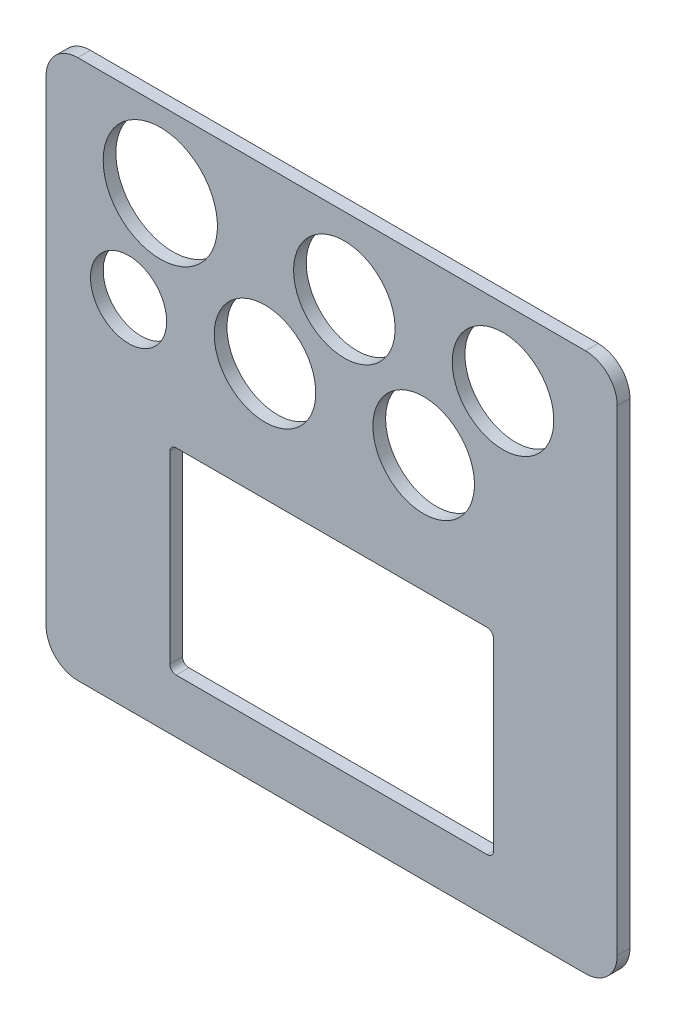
ISO-10303-21;
HEADER;
FILE_DESCRIPTION(('STEP AP214'),'2;1');
FILE_NAME('part.step','',(''),(''),'','','');
FILE_SCHEMA(('AUTOMOTIVE_DESIGN { 1 0 10303 214 1 1 1 1 }'));
ENDSEC;
DATA;
#1=APPLICATION_CONTEXT('core data for automotive mechanical design processes');
#2=APPLICATION_PROTOCOL_DEFINITION('international standard','automotive_design',2000,#1);
#3=PRODUCT_CONTEXT('',#1,'mechanical');
#4=PRODUCT('Part','Part','',(#3));
#5=PRODUCT_RELATED_PRODUCT_CATEGORY('part','',(#4));
#6=PRODUCT_DEFINITION_FORMATION('','',#4);
#7=PRODUCT_DEFINITION_CONTEXT('part definition',#1,'design');
#8=PRODUCT_DEFINITION('design','',#6,#7);
#9=PRODUCT_DEFINITION_SHAPE('','',#8);
#10=(LENGTH_UNIT() NAMED_UNIT(*) SI_UNIT(.MILLI.,.METRE.));
#11=(NAMED_UNIT(*) PLANE_ANGLE_UNIT() SI_UNIT($,.RADIAN.));
#12=(NAMED_UNIT(*) SI_UNIT($,.STERADIAN.) SOLID_ANGLE_UNIT());
#13=UNCERTAINTY_MEASURE_WITH_UNIT(LENGTH_MEASURE(1.E-05),#10,'distance_accuracy_value','');
#14=(GEOMETRIC_REPRESENTATION_CONTEXT(3) GLOBAL_UNCERTAINTY_ASSIGNED_CONTEXT((#13)) GLOBAL_UNIT_ASSIGNED_CONTEXT((#10,
#11,#12)) REPRESENTATION_CONTEXT('',''));
#15=CARTESIAN_POINT('',(0.,0.,0.));
#16=DIRECTION('',(0.,0.,1.));
#17=DIRECTION('',(1.,0.,0.));
#18=AXIS2_PLACEMENT_3D('',#15,#16,#17);
#19=CARTESIAN_POINT('',(40.,-37.5,0.));
#20=DIRECTION('',(0.,0.,1.));
#21=DIRECTION('',(1.,0.,0.));
#22=AXIS2_PLACEMENT_3D('',#19,#20,#21);
#23=PLANE('',#22);
#24=CARTESIAN_POINT('',(-32.,13.5,0.));
#25=DIRECTION('',(0.,0.,1.));
#26=DIRECTION('',(1.,0.,0.));
#27=AXIS2_PLACEMENT_3D('',#24,#25,#26);
#28=CIRCLE('',#27,6.);
#29=CARTESIAN_POINT('',(-26.,13.5,0.));
#30=VERTEX_POINT('',#29);
#31=EDGE_CURVE('E502',#30,#30,#28,.F.);
#32=ORIENTED_EDGE('',*,*,#31,.F.);
#33=EDGE_LOOP('',(#32));
#34=FACE_BOUND('',#33,.T.);
#35=CARTESIAN_POINT('',(2.,30.5,0.));
#36=DIRECTION('',(0.,0.,-1.));
#37=DIRECTION('',(-1.,0.,0.));
#38=AXIS2_PLACEMENT_3D('',#35,#36,#37);
#39=CIRCLE('',#38,8.);
#40=CARTESIAN_POINT('',(-6.,30.5,0.));
#41=VERTEX_POINT('',#40);
#42=EDGE_CURVE('E487',#41,#41,#39,.T.);
#43=ORIENTED_EDGE('',*,*,#42,.F.);
#44=EDGE_LOOP('',(#43));
#45=FACE_BOUND('',#44,.T.);
#46=CARTESIAN_POINT('',(14.5,15.5,0.));
#47=DIRECTION('',(0.,0.,-1.));
#48=DIRECTION('',(-1.,0.,0.));
#49=AXIS2_PLACEMENT_3D('',#46,#47,#48);
#50=CIRCLE('',#49,8.);
#51=CARTESIAN_POINT('',(6.5,15.5,0.));
#52=VERTEX_POINT('',#51);
#53=EDGE_CURVE('E481',#52,#52,#50,.T.);
#54=ORIENTED_EDGE('',*,*,#53,.F.);
#55=EDGE_LOOP('',(#54));
#56=FACE_BOUND('',#55,.T.);
#57=CARTESIAN_POINT('',(-27.,30.5,0.));
#58=DIRECTION('',(0.,0.,-1.));
#59=DIRECTION('',(-1.,0.,0.));
#60=AXIS2_PLACEMENT_3D('',#57,#58,#59);
#61=CIRCLE('',#60,9.);
#62=CARTESIAN_POINT('',(-36.,30.5,0.));
#63=VERTEX_POINT('',#62);
#64=EDGE_CURVE('E499',#63,#63,#61,.T.);
#65=ORIENTED_EDGE('',*,*,#64,.F.);
#66=EDGE_LOOP('',(#65));
#67=FACE_BOUND('',#66,.T.);
#68=CARTESIAN_POINT('',(-10.5,15.5,0.));
#69=DIRECTION('',(0.,0.,-1.));
#70=DIRECTION('',(-1.,0.,0.));
#71=AXIS2_PLACEMENT_3D('',#68,#69,#70);
#72=CIRCLE('',#71,8.);
#73=CARTESIAN_POINT('',(-18.5,15.5,0.));
#74=VERTEX_POINT('',#73);
#75=EDGE_CURVE('E493',#74,#74,#72,.T.);
#76=ORIENTED_EDGE('',*,*,#75,.F.);
#77=EDGE_LOOP('',(#76));
#78=FACE_BOUND('',#77,.T.);
#79=CARTESIAN_POINT('',(27.,30.5,0.));
#80=DIRECTION('',(0.,0.,-1.));
#81=DIRECTION('',(-1.,0.,0.));
#82=AXIS2_PLACEMENT_3D('',#79,#80,#81);
#83=CIRCLE('',#82,8.);
#84=CARTESIAN_POINT('',(19.,30.5,0.));
#85=VERTEX_POINT('',#84);
#86=EDGE_CURVE('E475',#85,#85,#83,.T.);
#87=ORIENTED_EDGE('',*,*,#86,.F.);
#88=EDGE_LOOP('',(#87));
#89=FACE_BOUND('',#88,.T.);
#90=DIRECTION('',(1.,0.,0.));
#91=VECTOR('',#90,1.);
#92=CARTESIAN_POINT('',(25.5,-3.,0.));
#93=LINE('',#92,#91);
#94=CARTESIAN_POINT('',(-24.5,-3.,0.));
#95=VERTEX_POINT('',#94);
#96=CARTESIAN_POINT('',(24.5,-3.,0.));
#97=VERTEX_POINT('',#96);
#98=EDGE_CURVE('E352',#95,#97,#93,.T.);
#99=ORIENTED_EDGE('',*,*,#98,.F.);
#100=CARTESIAN_POINT('',(-24.5,-4.,0.));
#101=DIRECTION('',(0.,0.,1.));
#102=DIRECTION('',(1.,0.,0.));
#103=AXIS2_PLACEMENT_3D('',#100,#101,#102);
#104=CIRCLE('',#103,1.);
#105=CARTESIAN_POINT('',(-25.5,-4.,0.));
#106=VERTEX_POINT('',#105);
#107=EDGE_CURVE('E346',#95,#106,#104,.T.);
#108=ORIENTED_EDGE('',*,*,#107,.T.);
#109=DIRECTION('',(0.,1.,0.));
#110=VECTOR('',#109,1.);
#111=CARTESIAN_POINT('',(-25.5,-3.,0.));
#112=LINE('',#111,#110);
#113=CARTESIAN_POINT('',(-25.5,-33.,0.));
#114=VERTEX_POINT('',#113);
#115=EDGE_CURVE('E359',#114,#106,#112,.T.);
#116=ORIENTED_EDGE('',*,*,#115,.F.);
#117=CARTESIAN_POINT('',(-24.5,-33.,0.));
#118=DIRECTION('',(0.,0.,1.));
#119=DIRECTION('',(1.,0.,0.));
#120=AXIS2_PLACEMENT_3D('',#117,#118,#119);
#121=CIRCLE('',#120,1.);
#122=CARTESIAN_POINT('',(-24.5,-34.,0.));
#123=VERTEX_POINT('',#122);
#124=EDGE_CURVE('E342',#114,#123,#121,.T.);
#125=ORIENTED_EDGE('',*,*,#124,.T.);
#126=DIRECTION('',(-1.,0.,0.));
#127=VECTOR('',#126,1.);
#128=CARTESIAN_POINT('',(25.5,-34.,0.));
#129=LINE('',#128,#127);
#130=CARTESIAN_POINT('',(24.5,-34.,0.));
#131=VERTEX_POINT('',#130);
#132=EDGE_CURVE('E384',#131,#123,#129,.T.);
#133=ORIENTED_EDGE('',*,*,#132,.F.);
#134=CARTESIAN_POINT('',(24.5,-33.,0.));
#135=DIRECTION('',(0.,0.,1.));
#136=DIRECTION('',(1.,0.,0.));
#137=AXIS2_PLACEMENT_3D('',#134,#135,#136);
#138=CIRCLE('',#137,1.);
#139=CARTESIAN_POINT('',(25.5,-33.,0.));
#140=VERTEX_POINT('',#139);
#141=EDGE_CURVE('E338',#131,#140,#138,.T.);
#142=ORIENTED_EDGE('',*,*,#141,.T.);
#143=DIRECTION('',(0.,-1.,0.));
#144=VECTOR('',#143,1.);
#145=CARTESIAN_POINT('',(25.5,-3.,0.));
#146=LINE('',#145,#144);
#147=CARTESIAN_POINT('',(25.5,-4.,0.));
#148=VERTEX_POINT('',#147);
#149=EDGE_CURVE('E354',#148,#140,#146,.T.);
#150=ORIENTED_EDGE('',*,*,#149,.F.);
#151=CARTESIAN_POINT('',(24.5,-4.,0.));
#152=DIRECTION('',(0.,0.,1.));
#153=DIRECTION('',(1.,0.,0.));
#154=AXIS2_PLACEMENT_3D('',#151,#152,#153);
#155=CIRCLE('',#154,1.);
#156=EDGE_CURVE('E44',#148,#97,#155,.T.);
#157=ORIENTED_EDGE('',*,*,#156,.T.);
#158=EDGE_LOOP('',(#99,#108,#116,#125,#133,#142,#150,#157));
#159=FACE_BOUND('',#158,.T.);
#160=DIRECTION('',(0.,1.,0.));
#161=VECTOR('',#160,1.);
#162=CARTESIAN_POINT('',(-27.5,-36.,0.));
#163=LINE('',#162,#161);
#164=CARTESIAN_POINT('',(-27.5,-39.,0.));
#165=VERTEX_POINT('',#164);
#166=CARTESIAN_POINT('',(-27.5,-36.,0.));
#167=VERTEX_POINT('',#166);
#168=EDGE_CURVE('E223',#165,#167,#163,.T.);
#169=ORIENTED_EDGE('',*,*,#168,.F.);
#170=DIRECTION('',(-1.,0.,0.));
#171=VECTOR('',#170,1.);
#172=CARTESIAN_POINT('',(27.5,-39.,0.));
#173=LINE('',#172,#171);
#174=CARTESIAN_POINT('',(27.5,-39.,0.));
#175=VERTEX_POINT('',#174);
#176=EDGE_CURVE('E236',#175,#165,#173,.T.);
#177=ORIENTED_EDGE('',*,*,#176,.F.);
#178=DIRECTION('',(0.,-1.,0.));
#179=VECTOR('',#178,1.);
#180=CARTESIAN_POINT('',(27.5,-36.,0.));
#181=LINE('',#180,#179);
#182=CARTESIAN_POINT('',(27.5,-36.,0.));
#183=VERTEX_POINT('',#182);
#184=EDGE_CURVE('E245',#183,#175,#181,.T.);
#185=ORIENTED_EDGE('',*,*,#184,.F.);
#186=DIRECTION('',(1.,0.,0.));
#187=VECTOR('',#186,1.);
#188=CARTESIAN_POINT('',(27.5,-36.,0.));
#189=LINE('',#188,#187);
#190=EDGE_CURVE('E226',#167,#183,#189,.T.);
#191=ORIENTED_EDGE('',*,*,#190,.F.);
#192=EDGE_LOOP('',(#169,#177,#185,#191));
#193=FACE_BOUND('',#192,.T.);
#194=CARTESIAN_POINT('',(40.,-37.5,0.));
#195=DIRECTION('',(0.,0.,1.));
#196=DIRECTION('',(1.,0.,0.));
#197=AXIS2_PLACEMENT_3D('',#194,#195,#196);
#198=CIRCLE('',#197,5.);
#199=CARTESIAN_POINT('',(40.,-42.5,0.));
#200=VERTEX_POINT('',#199);
#201=CARTESIAN_POINT('',(45.,-37.5,0.));
#202=VERTEX_POINT('',#201);
#203=EDGE_CURVE('E261',#200,#202,#198,.T.);
#204=ORIENTED_EDGE('',*,*,#203,.F.);
#205=DIRECTION('',(1.,0.,0.));
#206=VECTOR('',#205,1.);
#207=CARTESIAN_POINT('',(-40.,-42.5,0.));
#208=LINE('',#207,#206);
#209=CARTESIAN_POINT('',(-40.,-42.5,0.));
#210=VERTEX_POINT('',#209);
#211=EDGE_CURVE('E266',#210,#200,#208,.T.);
#212=ORIENTED_EDGE('',*,*,#211,.F.);
#213=CARTESIAN_POINT('',(-40.,-37.5,0.));
#214=DIRECTION('',(0.,0.,1.));
#215=DIRECTION('',(1.,0.,0.));
#216=AXIS2_PLACEMENT_3D('',#213,#214,#215);
#217=CIRCLE('',#216,5.);
#218=CARTESIAN_POINT('',(-45.,-37.5,0.));
#219=VERTEX_POINT('',#218);
#220=EDGE_CURVE('E293',#219,#210,#217,.T.);
#221=ORIENTED_EDGE('',*,*,#220,.F.);
#222=DIRECTION('',(0.,-1.,0.));
#223=VECTOR('',#222,1.);
#224=CARTESIAN_POINT('',(-45.,37.5,0.));
#225=LINE('',#224,#223);
#226=CARTESIAN_POINT('',(-45.,37.5,0.));
#227=VERTEX_POINT('',#226);
#228=EDGE_CURVE('E291',#227,#219,#225,.T.);
#229=ORIENTED_EDGE('',*,*,#228,.F.);
#230=CARTESIAN_POINT('',(-40.,37.5,0.));
#231=DIRECTION('',(0.,0.,1.));
#232=DIRECTION('',(1.,0.,0.));
#233=AXIS2_PLACEMENT_3D('',#230,#231,#232);
#234=CIRCLE('',#233,5.);
#235=CARTESIAN_POINT('',(-40.,42.5,0.));
#236=VERTEX_POINT('',#235);
#237=EDGE_CURVE('E289',#236,#227,#234,.T.);
#238=ORIENTED_EDGE('',*,*,#237,.F.);
#239=DIRECTION('',(-1.,0.,0.));
#240=VECTOR('',#239,1.);
#241=CARTESIAN_POINT('',(-40.,42.5,0.));
#242=LINE('',#241,#240);
#243=CARTESIAN_POINT('',(39.9999999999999,42.5,0.));
#244=VERTEX_POINT('',#243);
#245=EDGE_CURVE('E287',#244,#236,#242,.T.);
#246=ORIENTED_EDGE('',*,*,#245,.F.);
#247=CARTESIAN_POINT('',(40.,37.5,0.));
#248=DIRECTION('',(0.,0.,1.));
#249=DIRECTION('',(-1.,0.,0.));
#250=AXIS2_PLACEMENT_3D('',#247,#248,#249);
#251=CIRCLE('',#250,5.);
#252=CARTESIAN_POINT('',(45.,37.5,0.));
#253=VERTEX_POINT('',#252);
#254=EDGE_CURVE('E285',#253,#244,#251,.T.);
#255=ORIENTED_EDGE('',*,*,#254,.F.);
#256=DIRECTION('',(0.,1.,0.));
#257=VECTOR('',#256,1.);
#258=CARTESIAN_POINT('',(45.,37.5,0.));
#259=LINE('',#258,#257);
#260=EDGE_CURVE('E283',#202,#253,#259,.T.);
#261=ORIENTED_EDGE('',*,*,#260,.F.);
#262=EDGE_LOOP('',(#204,#212,#221,#229,#238,#246,#255,#261));
#263=FACE_BOUND('',#262,.T.);
#264=DIRECTION('',(0.,1.,0.));
#265=VECTOR('',#264,1.);
#266=CARTESIAN_POINT('',(-27.5,2.,0.));
#267=LINE('',#266,#265);
#268=CARTESIAN_POINT('',(-27.5,-1.,0.));
#269=VERTEX_POINT('',#268);
#270=CARTESIAN_POINT('',(-27.5,2.,0.));
#271=VERTEX_POINT('',#270);
#272=EDGE_CURVE('E222',#269,#271,#267,.T.);
#273=ORIENTED_EDGE('',*,*,#272,.F.);
#274=DIRECTION('',(-1.,0.,0.));
#275=VECTOR('',#274,1.);
#276=CARTESIAN_POINT('',(27.5,-1.,0.));
#277=LINE('',#276,#275);
#278=CARTESIAN_POINT('',(27.5,-1.,0.));
#279=VERTEX_POINT('',#278);
#280=EDGE_CURVE('E219',#279,#269,#277,.T.);
#281=ORIENTED_EDGE('',*,*,#280,.F.);
#282=DIRECTION('',(0.,-1.,0.));
#283=VECTOR('',#282,1.);
#284=CARTESIAN_POINT('',(27.5,2.,0.));
#285=LINE('',#284,#283);
#286=CARTESIAN_POINT('',(27.5,1.99999999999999,0.));
#287=VERTEX_POINT('',#286);
#288=EDGE_CURVE('E393',#287,#279,#285,.T.);
#289=ORIENTED_EDGE('',*,*,#288,.F.);
#290=DIRECTION('',(1.,0.,0.));
#291=VECTOR('',#290,1.);
#292=CARTESIAN_POINT('',(27.5,2.,0.));
#293=LINE('',#292,#291);
#294=EDGE_CURVE('E391',#271,#287,#293,.T.);
#295=ORIENTED_EDGE('',*,*,#294,.F.);
#296=EDGE_LOOP('',(#273,#281,#289,#295));
#297=FACE_BOUND('',#296,.T.);
#298=ADVANCED_FACE('F36',(#34,#45,#56,#67,#78,#89,#159,#193,#263,#297),#23,.F.);
#299=CARTESIAN_POINT('',(40.,-37.5,2.));
#300=DIRECTION('',(0.,0.,-1.));
#301=DIRECTION('',(-1.,0.,0.));
#302=AXIS2_PLACEMENT_3D('',#299,#300,#301);
#303=CYLINDRICAL_SURFACE('',#302,5.);
#304=ORIENTED_EDGE('',*,*,#203,.T.);
#305=DIRECTION('',(0.,0.,-1.));
#306=VECTOR('',#305,1.);
#307=CARTESIAN_POINT('',(45.,-37.5,2.));
#308=LINE('',#307,#306);
#309=CARTESIAN_POINT('',(45.,-37.5,2.));
#310=VERTEX_POINT('',#309);
#311=EDGE_CURVE('E316',#310,#202,#308,.T.);
#312=ORIENTED_EDGE('',*,*,#311,.F.);
#313=CARTESIAN_POINT('',(40.,-37.5,2.));
#314=DIRECTION('',(0.,0.,1.));
#315=DIRECTION('',(1.,0.,0.));
#316=AXIS2_PLACEMENT_3D('',#313,#314,#315);
#317=CIRCLE('',#316,5.);
#318=CARTESIAN_POINT('',(40.,-42.5,2.));
#319=VERTEX_POINT('',#318);
#320=EDGE_CURVE('E262',#319,#310,#317,.T.);
#321=ORIENTED_EDGE('',*,*,#320,.F.);
#322=DIRECTION('',(0.,0.,-1.));
#323=VECTOR('',#322,1.);
#324=CARTESIAN_POINT('',(40.,-42.5,2.));
#325=LINE('',#324,#323);
#326=EDGE_CURVE('E280',#319,#200,#325,.T.);
#327=ORIENTED_EDGE('',*,*,#326,.T.);
#328=EDGE_LOOP('',(#304,#312,#321,#327));
#329=FACE_BOUND('',#328,.T.);
#330=ADVANCED_FACE('F406',(#329),#303,.T.);
#331=CARTESIAN_POINT('',(45.,37.5,2.));
#332=DIRECTION('',(-1.,0.,0.));
#333=DIRECTION('',(0.,-1.,0.));
#334=AXIS2_PLACEMENT_3D('',#331,#332,#333);
#335=PLANE('',#334);
#336=ORIENTED_EDGE('',*,*,#260,.T.);
#337=DIRECTION('',(0.,0.,-1.));
#338=VECTOR('',#337,1.);
#339=CARTESIAN_POINT('',(45.,37.5,2.));
#340=LINE('',#339,#338);
#341=CARTESIAN_POINT('',(45.,37.5,2.));
#342=VERTEX_POINT('',#341);
#343=EDGE_CURVE('E313',#342,#253,#340,.T.);
#344=ORIENTED_EDGE('',*,*,#343,.F.);
#345=DIRECTION('',(0.,1.,0.));
#346=VECTOR('',#345,1.);
#347=CARTESIAN_POINT('',(45.,37.5,2.));
#348=LINE('',#347,#346);
#349=EDGE_CURVE('E265',#310,#342,#348,.T.);
#350=ORIENTED_EDGE('',*,*,#349,.F.);
#351=ORIENTED_EDGE('',*,*,#311,.T.);
#352=EDGE_LOOP('',(#336,#344,#350,#351));
#353=FACE_BOUND('',#352,.T.);
#354=ADVANCED_FACE('F412',(#353),#335,.F.);
#355=CARTESIAN_POINT('',(40.,37.5,2.));
#356=DIRECTION('',(0.,0.,-1.));
#357=DIRECTION('',(-1.,0.,0.));
#358=AXIS2_PLACEMENT_3D('',#355,#356,#357);
#359=CYLINDRICAL_SURFACE('',#358,5.);
#360=ORIENTED_EDGE('',*,*,#254,.T.);
#361=DIRECTION('',(0.,0.,-1.));
#362=VECTOR('',#361,1.);
#363=CARTESIAN_POINT('',(39.9999999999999,42.5,2.));
#364=LINE('',#363,#362);
#365=CARTESIAN_POINT('',(39.9999999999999,42.5,2.));
#366=VERTEX_POINT('',#365);
#367=EDGE_CURVE('E310',#366,#244,#364,.T.);
#368=ORIENTED_EDGE('',*,*,#367,.F.);
#369=CARTESIAN_POINT('',(40.,37.5,2.));
#370=DIRECTION('',(0.,0.,1.));
#371=DIRECTION('',(-1.,0.,0.));
#372=AXIS2_PLACEMENT_3D('',#369,#370,#371);
#373=CIRCLE('',#372,5.);
#374=EDGE_CURVE('E268',#342,#366,#373,.T.);
#375=ORIENTED_EDGE('',*,*,#374,.F.);
#376=ORIENTED_EDGE('',*,*,#343,.T.);
#377=EDGE_LOOP('',(#360,#368,#375,#376));
#378=FACE_BOUND('',#377,.T.);
#379=ADVANCED_FACE('F439',(#378),#359,.T.);
#380=CARTESIAN_POINT('',(-40.,42.5,2.));
#381=DIRECTION('',(0.,-1.,0.));
#382=DIRECTION('',(0.,0.,-1.));
#383=AXIS2_PLACEMENT_3D('',#380,#381,#382);
#384=PLANE('',#383);
#385=ORIENTED_EDGE('',*,*,#245,.T.);
#386=DIRECTION('',(0.,0.,-1.));
#387=VECTOR('',#386,1.);
#388=CARTESIAN_POINT('',(-40.,42.5,2.));
#389=LINE('',#388,#387);
#390=CARTESIAN_POINT('',(-40.,42.5,2.));
#391=VERTEX_POINT('',#390);
#392=EDGE_CURVE('E307',#391,#236,#389,.T.);
#393=ORIENTED_EDGE('',*,*,#392,.F.);
#394=DIRECTION('',(-1.,0.,0.));
#395=VECTOR('',#394,1.);
#396=CARTESIAN_POINT('',(-40.,42.5,2.));
#397=LINE('',#396,#395);
#398=EDGE_CURVE('E270',#366,#391,#397,.T.);
#399=ORIENTED_EDGE('',*,*,#398,.F.);
#400=ORIENTED_EDGE('',*,*,#367,.T.);
#401=EDGE_LOOP('',(#385,#393,#399,#400));
#402=FACE_BOUND('',#401,.T.);
#403=ADVANCED_FACE('F435',(#402),#384,.F.);
#404=CARTESIAN_POINT('',(-40.,37.5,2.));
#405=DIRECTION('',(0.,0.,-1.));
#406=DIRECTION('',(-1.,0.,0.));
#407=AXIS2_PLACEMENT_3D('',#404,#405,#406);
#408=CYLINDRICAL_SURFACE('',#407,5.);
#409=ORIENTED_EDGE('',*,*,#237,.T.);
#410=DIRECTION('',(0.,0.,-1.));
#411=VECTOR('',#410,1.);
#412=CARTESIAN_POINT('',(-45.,37.5,2.));
#413=LINE('',#412,#411);
#414=CARTESIAN_POINT('',(-45.,37.5,2.));
#415=VERTEX_POINT('',#414);
#416=EDGE_CURVE('E304',#415,#227,#413,.T.);
#417=ORIENTED_EDGE('',*,*,#416,.F.);
#418=CARTESIAN_POINT('',(-40.,37.5,2.));
#419=DIRECTION('',(0.,0.,1.));
#420=DIRECTION('',(1.,0.,0.));
#421=AXIS2_PLACEMENT_3D('',#418,#419,#420);
#422=CIRCLE('',#421,5.);
#423=EDGE_CURVE('E272',#391,#415,#422,.T.);
#424=ORIENTED_EDGE('',*,*,#423,.F.);
#425=ORIENTED_EDGE('',*,*,#392,.T.);
#426=EDGE_LOOP('',(#409,#417,#424,#425));
#427=FACE_BOUND('',#426,.T.);
#428=ADVANCED_FACE('F431',(#427),#408,.T.);
#429=CARTESIAN_POINT('',(-45.,37.5,2.));
#430=DIRECTION('',(1.,0.,0.));
#431=DIRECTION('',(0.,1.,0.));
#432=AXIS2_PLACEMENT_3D('',#429,#430,#431);
#433=PLANE('',#432);
#434=ORIENTED_EDGE('',*,*,#228,.T.);
#435=DIRECTION('',(0.,0.,-1.));
#436=VECTOR('',#435,1.);
#437=CARTESIAN_POINT('',(-45.,-37.5,2.));
#438=LINE('',#437,#436);
#439=CARTESIAN_POINT('',(-45.,-37.5,2.));
#440=VERTEX_POINT('',#439);
#441=EDGE_CURVE('E301',#440,#219,#438,.T.);
#442=ORIENTED_EDGE('',*,*,#441,.F.);
#443=DIRECTION('',(0.,-1.,0.));
#444=VECTOR('',#443,1.);
#445=CARTESIAN_POINT('',(-45.,37.5,2.));
#446=LINE('',#445,#444);
#447=EDGE_CURVE('E274',#415,#440,#446,.T.);
#448=ORIENTED_EDGE('',*,*,#447,.F.);
#449=ORIENTED_EDGE('',*,*,#416,.T.);
#450=EDGE_LOOP('',(#434,#442,#448,#449));
#451=FACE_BOUND('',#450,.T.);
#452=ADVANCED_FACE('F427',(#451),#433,.F.);
#453=CARTESIAN_POINT('',(-40.,-37.5,2.));
#454=DIRECTION('',(0.,0.,-1.));
#455=DIRECTION('',(-1.,0.,0.));
#456=AXIS2_PLACEMENT_3D('',#453,#454,#455);
#457=CYLINDRICAL_SURFACE('',#456,5.);
#458=ORIENTED_EDGE('',*,*,#220,.T.);
#459=DIRECTION('',(0.,0.,-1.));
#460=VECTOR('',#459,1.);
#461=CARTESIAN_POINT('',(-40.,-42.5,2.));
#462=LINE('',#461,#460);
#463=CARTESIAN_POINT('',(-40.,-42.5,2.));
#464=VERTEX_POINT('',#463);
#465=EDGE_CURVE('E298',#464,#210,#462,.T.);
#466=ORIENTED_EDGE('',*,*,#465,.F.);
#467=CARTESIAN_POINT('',(-40.,-37.5,2.));
#468=DIRECTION('',(0.,0.,1.));
#469=DIRECTION('',(1.,0.,0.));
#470=AXIS2_PLACEMENT_3D('',#467,#468,#469);
#471=CIRCLE('',#470,5.);
#472=EDGE_CURVE('E276',#440,#464,#471,.T.);
#473=ORIENTED_EDGE('',*,*,#472,.F.);
#474=ORIENTED_EDGE('',*,*,#441,.T.);
#475=EDGE_LOOP('',(#458,#466,#473,#474));
#476=FACE_BOUND('',#475,.T.);
#477=ADVANCED_FACE('F423',(#476),#457,.T.);
#478=CARTESIAN_POINT('',(-40.,-42.5,2.));
#479=DIRECTION('',(0.,1.,0.));
#480=DIRECTION('',(0.,0.,1.));
#481=AXIS2_PLACEMENT_3D('',#478,#479,#480);
#482=PLANE('',#481);
#483=ORIENTED_EDGE('',*,*,#211,.T.);
#484=ORIENTED_EDGE('',*,*,#326,.F.);
#485=DIRECTION('',(1.,0.,0.));
#486=VECTOR('',#485,1.);
#487=CARTESIAN_POINT('',(-40.,-42.5,2.));
#488=LINE('',#487,#486);
#489=EDGE_CURVE('E278',#464,#319,#488,.T.);
#490=ORIENTED_EDGE('',*,*,#489,.F.);
#491=ORIENTED_EDGE('',*,*,#465,.T.);
#492=EDGE_LOOP('',(#483,#484,#490,#491));
#493=FACE_BOUND('',#492,.T.);
#494=ADVANCED_FACE('F420',(#493),#482,.F.);
#495=CARTESIAN_POINT('',(40.,-37.5,2.));
#496=DIRECTION('',(0.,0.,1.));
#497=DIRECTION('',(1.,0.,0.));
#498=AXIS2_PLACEMENT_3D('',#495,#496,#497);
#499=PLANE('',#498);
#500=CARTESIAN_POINT('',(-32.,13.5,2.));
#501=DIRECTION('',(0.,0.,1.));
#502=DIRECTION('',(1.,0.,0.));
#503=AXIS2_PLACEMENT_3D('',#500,#501,#502);
#504=CIRCLE('',#503,6.);
#505=CARTESIAN_POINT('',(-26.,13.5,2.));
#506=VERTEX_POINT('',#505);
#507=EDGE_CURVE('E507',#506,#506,#504,.T.);
#508=ORIENTED_EDGE('',*,*,#507,.F.);
#509=EDGE_LOOP('',(#508));
#510=FACE_BOUND('',#509,.T.);
#511=CARTESIAN_POINT('',(2.,30.5,2.));
#512=DIRECTION('',(0.,0.,-1.));
#513=DIRECTION('',(-1.,0.,0.));
#514=AXIS2_PLACEMENT_3D('',#511,#512,#513);
#515=CIRCLE('',#514,8.);
#516=CARTESIAN_POINT('',(-6.,30.5,2.));
#517=VERTEX_POINT('',#516);
#518=EDGE_CURVE('E484',#517,#517,#515,.T.);
#519=ORIENTED_EDGE('',*,*,#518,.T.);
#520=EDGE_LOOP('',(#519));
#521=FACE_BOUND('',#520,.T.);
#522=CARTESIAN_POINT('',(14.5,15.5,2.));
#523=DIRECTION('',(0.,0.,-1.));
#524=DIRECTION('',(-1.,0.,0.));
#525=AXIS2_PLACEMENT_3D('',#522,#523,#524);
#526=CIRCLE('',#525,8.);
#527=CARTESIAN_POINT('',(6.5,15.5,2.));
#528=VERTEX_POINT('',#527);
#529=EDGE_CURVE('E478',#528,#528,#526,.T.);
#530=ORIENTED_EDGE('',*,*,#529,.T.);
#531=EDGE_LOOP('',(#530));
#532=FACE_BOUND('',#531,.T.);
#533=CARTESIAN_POINT('',(-27.,30.5,2.));
#534=DIRECTION('',(0.,0.,-1.));
#535=DIRECTION('',(-1.,0.,0.));
#536=AXIS2_PLACEMENT_3D('',#533,#534,#535);
#537=CIRCLE('',#536,9.);
#538=CARTESIAN_POINT('',(-36.,30.5,2.));
#539=VERTEX_POINT('',#538);
#540=EDGE_CURVE('E496',#539,#539,#537,.T.);
#541=ORIENTED_EDGE('',*,*,#540,.T.);
#542=EDGE_LOOP('',(#541));
#543=FACE_BOUND('',#542,.T.);
#544=CARTESIAN_POINT('',(-10.5,15.5,2.));
#545=DIRECTION('',(0.,0.,-1.));
#546=DIRECTION('',(-1.,0.,0.));
#547=AXIS2_PLACEMENT_3D('',#544,#545,#546);
#548=CIRCLE('',#547,8.);
#549=CARTESIAN_POINT('',(-18.5,15.5,2.));
#550=VERTEX_POINT('',#549);
#551=EDGE_CURVE('E490',#550,#550,#548,.T.);
#552=ORIENTED_EDGE('',*,*,#551,.T.);
#553=EDGE_LOOP('',(#552));
#554=FACE_BOUND('',#553,.T.);
#555=CARTESIAN_POINT('',(27.,30.5,2.));
#556=DIRECTION('',(0.,0.,-1.));
#557=DIRECTION('',(-1.,0.,0.));
#558=AXIS2_PLACEMENT_3D('',#555,#556,#557);
#559=CIRCLE('',#558,8.);
#560=CARTESIAN_POINT('',(19.,30.5,2.));
#561=VERTEX_POINT('',#560);
#562=EDGE_CURVE('E381',#561,#561,#559,.T.);
#563=ORIENTED_EDGE('',*,*,#562,.T.);
#564=EDGE_LOOP('',(#563));
#565=FACE_BOUND('',#564,.T.);
#566=DIRECTION('',(-1.,0.,0.));
#567=VECTOR('',#566,1.);
#568=CARTESIAN_POINT('',(25.5,-34.,2.));
#569=LINE('',#568,#567);
#570=CARTESIAN_POINT('',(24.5,-34.,2.));
#571=VERTEX_POINT('',#570);
#572=CARTESIAN_POINT('',(-24.5,-34.,2.));
#573=VERTEX_POINT('',#572);
#574=EDGE_CURVE('E373',#571,#573,#569,.T.);
#575=ORIENTED_EDGE('',*,*,#574,.T.);
#576=CARTESIAN_POINT('',(-24.5,-33.,2.));
#577=DIRECTION('',(0.,0.,1.));
#578=DIRECTION('',(1.,0.,0.));
#579=AXIS2_PLACEMENT_3D('',#576,#577,#578);
#580=CIRCLE('',#579,1.);
#581=CARTESIAN_POINT('',(-25.5,-33.,2.));
#582=VERTEX_POINT('',#581);
#583=EDGE_CURVE('E344',#573,#582,#580,.F.);
#584=ORIENTED_EDGE('',*,*,#583,.T.);
#585=DIRECTION('',(0.,1.,0.));
#586=VECTOR('',#585,1.);
#587=CARTESIAN_POINT('',(-25.5,-3.,2.));
#588=LINE('',#587,#586);
#589=CARTESIAN_POINT('',(-25.5,-4.,2.));
#590=VERTEX_POINT('',#589);
#591=EDGE_CURVE('E376',#582,#590,#588,.T.);
#592=ORIENTED_EDGE('',*,*,#591,.T.);
#593=CARTESIAN_POINT('',(-24.5,-4.,2.));
#594=DIRECTION('',(0.,0.,1.));
#595=DIRECTION('',(1.,0.,0.));
#596=AXIS2_PLACEMENT_3D('',#593,#594,#595);
#597=CIRCLE('',#596,1.);
#598=CARTESIAN_POINT('',(-24.5,-3.,2.));
#599=VERTEX_POINT('',#598);
#600=EDGE_CURVE('E58',#590,#599,#597,.F.);
#601=ORIENTED_EDGE('',*,*,#600,.T.);
#602=DIRECTION('',(1.,0.,0.));
#603=VECTOR('',#602,1.);
#604=CARTESIAN_POINT('',(25.5,-3.,2.));
#605=LINE('',#604,#603);
#606=CARTESIAN_POINT('',(24.5,-3.,2.));
#607=VERTEX_POINT('',#606);
#608=EDGE_CURVE('E369',#599,#607,#605,.T.);
#609=ORIENTED_EDGE('',*,*,#608,.T.);
#610=CARTESIAN_POINT('',(24.5,-4.,2.));
#611=DIRECTION('',(0.,0.,1.));
#612=DIRECTION('',(1.,0.,0.));
#613=AXIS2_PLACEMENT_3D('',#610,#611,#612);
#614=CIRCLE('',#613,1.);
#615=CARTESIAN_POINT('',(25.5,-4.,2.));
#616=VERTEX_POINT('',#615);
#617=EDGE_CURVE('E11',#607,#616,#614,.F.);
#618=ORIENTED_EDGE('',*,*,#617,.T.);
#619=DIRECTION('',(0.,-1.,0.));
#620=VECTOR('',#619,1.);
#621=CARTESIAN_POINT('',(25.5,-3.,2.));
#622=LINE('',#621,#620);
#623=CARTESIAN_POINT('',(25.5,-33.,2.));
#624=VERTEX_POINT('',#623);
#625=EDGE_CURVE('E367',#616,#624,#622,.T.);
#626=ORIENTED_EDGE('',*,*,#625,.T.);
#627=CARTESIAN_POINT('',(24.5,-33.,2.));
#628=DIRECTION('',(0.,0.,1.));
#629=DIRECTION('',(1.,0.,0.));
#630=AXIS2_PLACEMENT_3D('',#627,#628,#629);
#631=CIRCLE('',#630,1.);
#632=EDGE_CURVE('E340',#624,#571,#631,.F.);
#633=ORIENTED_EDGE('',*,*,#632,.T.);
#634=EDGE_LOOP('',(#575,#584,#592,#601,#609,#618,#626,#633));
#635=FACE_BOUND('',#634,.T.);
#636=ORIENTED_EDGE('',*,*,#320,.T.);
#637=ORIENTED_EDGE('',*,*,#349,.T.);
#638=ORIENTED_EDGE('',*,*,#374,.T.);
#639=ORIENTED_EDGE('',*,*,#398,.T.);
#640=ORIENTED_EDGE('',*,*,#423,.T.);
#641=ORIENTED_EDGE('',*,*,#447,.T.);
#642=ORIENTED_EDGE('',*,*,#472,.T.);
#643=ORIENTED_EDGE('',*,*,#489,.T.);
#644=EDGE_LOOP('',(#636,#637,#638,#639,#640,#641,#642,#643));
#645=FACE_BOUND('',#644,.T.);
#646=ADVANCED_FACE('F365',(#510,#521,#532,#543,#554,#565,#635,#645),#499,.T.);
#647=CARTESIAN_POINT('',(-27.5,-36.,-0.01));
#648=DIRECTION('',(1.,0.,0.));
#649=DIRECTION('',(0.,0.,-1.));
#650=AXIS2_PLACEMENT_3D('',#647,#648,#649);
#651=PLANE('',#650);
#652=ORIENTED_EDGE('',*,*,#168,.T.);
#653=DIRECTION('',(0.,0.,1.));
#654=VECTOR('',#653,1.);
#655=CARTESIAN_POINT('',(-27.5,-36.,-0.01));
#656=LINE('',#655,#654);
#657=CARTESIAN_POINT('',(-27.5,-36.,-0.01));
#658=VERTEX_POINT('',#657);
#659=EDGE_CURVE('E258',#658,#167,#656,.T.);
#660=ORIENTED_EDGE('',*,*,#659,.F.);
#661=DIRECTION('',(0.,1.,0.));
#662=VECTOR('',#661,1.);
#663=CARTESIAN_POINT('',(-27.5,-36.,-0.01));
#664=LINE('',#663,#662);
#665=CARTESIAN_POINT('',(-27.5,-39.,-0.01));
#666=VERTEX_POINT('',#665);
#667=EDGE_CURVE('E232',#666,#658,#664,.T.);
#668=ORIENTED_EDGE('',*,*,#667,.F.);
#669=DIRECTION('',(0.,0.,1.));
#670=VECTOR('',#669,1.);
#671=CARTESIAN_POINT('',(-27.5,-39.,-0.01));
#672=LINE('',#671,#670);
#673=EDGE_CURVE('E241',#666,#165,#672,.T.);
#674=ORIENTED_EDGE('',*,*,#673,.T.);
#675=EDGE_LOOP('',(#652,#660,#668,#674));
#676=FACE_BOUND('',#675,.T.);
#677=ADVANCED_FACE('F515',(#676),#651,.F.);
#678=CARTESIAN_POINT('',(27.5,-36.,-0.01));
#679=DIRECTION('',(0.,-1.,0.));
#680=DIRECTION('',(0.,0.,-1.));
#681=AXIS2_PLACEMENT_3D('',#678,#679,#680);
#682=PLANE('',#681);
#683=ORIENTED_EDGE('',*,*,#190,.T.);
#684=DIRECTION('',(0.,0.,1.));
#685=VECTOR('',#684,1.);
#686=CARTESIAN_POINT('',(27.5,-36.,-0.01));
#687=LINE('',#686,#685);
#688=CARTESIAN_POINT('',(27.5,-36.,-0.01));
#689=VERTEX_POINT('',#688);
#690=EDGE_CURVE('E255',#689,#183,#687,.T.);
#691=ORIENTED_EDGE('',*,*,#690,.F.);
#692=DIRECTION('',(1.,0.,0.));
#693=VECTOR('',#692,1.);
#694=CARTESIAN_POINT('',(27.5,-36.,-0.01));
#695=LINE('',#694,#693);
#696=EDGE_CURVE('E235',#658,#689,#695,.T.);
#697=ORIENTED_EDGE('',*,*,#696,.F.);
#698=ORIENTED_EDGE('',*,*,#659,.T.);
#699=EDGE_LOOP('',(#683,#691,#697,#698));
#700=FACE_BOUND('',#699,.T.);
#701=ADVANCED_FACE('F571',(#700),#682,.F.);
#702=CARTESIAN_POINT('',(27.5,-36.,-0.01));
#703=DIRECTION('',(-1.,0.,0.));
#704=DIRECTION('',(0.,0.,1.));
#705=AXIS2_PLACEMENT_3D('',#702,#703,#704);
#706=PLANE('',#705);
#707=ORIENTED_EDGE('',*,*,#184,.T.);
#708=DIRECTION('',(0.,0.,1.));
#709=VECTOR('',#708,1.);
#710=CARTESIAN_POINT('',(27.5,-39.,-0.01));
#711=LINE('',#710,#709);
#712=CARTESIAN_POINT('',(27.5,-39.,-0.01));
#713=VERTEX_POINT('',#712);
#714=EDGE_CURVE('E252',#713,#175,#711,.T.);
#715=ORIENTED_EDGE('',*,*,#714,.F.);
#716=DIRECTION('',(0.,-1.,0.));
#717=VECTOR('',#716,1.);
#718=CARTESIAN_POINT('',(27.5,-36.,-0.01));
#719=LINE('',#718,#717);
#720=EDGE_CURVE('E238',#689,#713,#719,.T.);
#721=ORIENTED_EDGE('',*,*,#720,.F.);
#722=ORIENTED_EDGE('',*,*,#690,.T.);
#723=EDGE_LOOP('',(#707,#715,#721,#722));
#724=FACE_BOUND('',#723,.T.);
#725=ADVANCED_FACE('F567',(#724),#706,.F.);
#726=CARTESIAN_POINT('',(27.5,-39.,-0.01));
#727=DIRECTION('',(0.,1.,0.));
#728=DIRECTION('',(0.,0.,1.));
#729=AXIS2_PLACEMENT_3D('',#726,#727,#728);
#730=PLANE('',#729);
#731=ORIENTED_EDGE('',*,*,#176,.T.);
#732=ORIENTED_EDGE('',*,*,#673,.F.);
#733=DIRECTION('',(-1.,0.,0.));
#734=VECTOR('',#733,1.);
#735=CARTESIAN_POINT('',(27.5,-39.,-0.01));
#736=LINE('',#735,#734);
#737=EDGE_CURVE('E240',#713,#666,#736,.T.);
#738=ORIENTED_EDGE('',*,*,#737,.F.);
#739=ORIENTED_EDGE('',*,*,#714,.T.);
#740=EDGE_LOOP('',(#731,#732,#738,#739));
#741=FACE_BOUND('',#740,.T.);
#742=ADVANCED_FACE('F563',(#741),#730,.F.);
#743=CARTESIAN_POINT('',(0.,0.,-0.01));
#744=DIRECTION('',(0.,0.,-1.));
#745=DIRECTION('',(-1.,0.,0.));
#746=AXIS2_PLACEMENT_3D('',#743,#744,#745);
#747=PLANE('',#746);
#748=ORIENTED_EDGE('',*,*,#667,.T.);
#749=ORIENTED_EDGE('',*,*,#696,.T.);
#750=ORIENTED_EDGE('',*,*,#720,.T.);
#751=ORIENTED_EDGE('',*,*,#737,.T.);
#752=EDGE_LOOP('',(#748,#749,#750,#751));
#753=FACE_BOUND('',#752,.T.);
#754=ADVANCED_FACE('F560',(#753),#747,.T.);
#755=CARTESIAN_POINT('',(-27.5,2.,-0.01));
#756=DIRECTION('',(1.,0.,0.));
#757=DIRECTION('',(0.,0.,-1.));
#758=AXIS2_PLACEMENT_3D('',#755,#756,#757);
#759=PLANE('',#758);
#760=ORIENTED_EDGE('',*,*,#272,.T.);
#761=DIRECTION('',(0.,0.,1.));
#762=VECTOR('',#761,1.);
#763=CARTESIAN_POINT('',(-27.5,2.,-0.01));
#764=LINE('',#763,#762);
#765=CARTESIAN_POINT('',(-27.5,2.,-0.01));
#766=VERTEX_POINT('',#765);
#767=EDGE_CURVE('E203',#766,#271,#764,.T.);
#768=ORIENTED_EDGE('',*,*,#767,.F.);
#769=DIRECTION('',(0.,1.,0.));
#770=VECTOR('',#769,1.);
#771=CARTESIAN_POINT('',(-27.5,2.,-0.01));
#772=LINE('',#771,#770);
#773=CARTESIAN_POINT('',(-27.5,-1.,-0.01));
#774=VERTEX_POINT('',#773);
#775=EDGE_CURVE('E210',#774,#766,#772,.T.);
#776=ORIENTED_EDGE('',*,*,#775,.F.);
#777=DIRECTION('',(0.,0.,1.));
#778=VECTOR('',#777,1.);
#779=CARTESIAN_POINT('',(-27.5,-1.,-0.01));
#780=LINE('',#779,#778);
#781=EDGE_CURVE('E389',#774,#269,#780,.T.);
#782=ORIENTED_EDGE('',*,*,#781,.T.);
#783=EDGE_LOOP('',(#760,#768,#776,#782));
#784=FACE_BOUND('',#783,.T.);
#785=ADVANCED_FACE('F221',(#784),#759,.F.);
#786=CARTESIAN_POINT('',(27.5,2.,-0.01));
#787=DIRECTION('',(0.,-1.,0.));
#788=DIRECTION('',(1.,0.,0.));
#789=AXIS2_PLACEMENT_3D('',#786,#787,#788);
#790=PLANE('',#789);
#791=ORIENTED_EDGE('',*,*,#294,.T.);
#792=DIRECTION('',(0.,0.,1.));
#793=VECTOR('',#792,1.);
#794=CARTESIAN_POINT('',(27.5,2.,-0.01));
#795=LINE('',#794,#793);
#796=CARTESIAN_POINT('',(27.5,2.,-0.01));
#797=VERTEX_POINT('',#796);
#798=EDGE_CURVE('E206',#797,#287,#795,.T.);
#799=ORIENTED_EDGE('',*,*,#798,.F.);
#800=DIRECTION('',(1.,0.,0.));
#801=VECTOR('',#800,1.);
#802=CARTESIAN_POINT('',(27.5,2.,-0.01));
#803=LINE('',#802,#801);
#804=EDGE_CURVE('E198',#766,#797,#803,.T.);
#805=ORIENTED_EDGE('',*,*,#804,.F.);
#806=ORIENTED_EDGE('',*,*,#767,.T.);
#807=EDGE_LOOP('',(#791,#799,#805,#806));
#808=FACE_BOUND('',#807,.T.);
#809=ADVANCED_FACE('F201',(#808),#790,.F.);
#810=CARTESIAN_POINT('',(27.5,2.,-0.01));
#811=DIRECTION('',(-1.,0.,0.));
#812=DIRECTION('',(0.,-1.,0.));
#813=AXIS2_PLACEMENT_3D('',#810,#811,#812);
#814=PLANE('',#813);
#815=ORIENTED_EDGE('',*,*,#288,.T.);
#816=DIRECTION('',(0.,0.,1.));
#817=VECTOR('',#816,1.);
#818=CARTESIAN_POINT('',(27.5,-1.,-0.01));
#819=LINE('',#818,#817);
#820=CARTESIAN_POINT('',(27.5,-1.,-0.01));
#821=VERTEX_POINT('',#820);
#822=EDGE_CURVE('E228',#821,#279,#819,.T.);
#823=ORIENTED_EDGE('',*,*,#822,.F.);
#824=DIRECTION('',(0.,-1.,0.));
#825=VECTOR('',#824,1.);
#826=CARTESIAN_POINT('',(27.5,2.,-0.01));
#827=LINE('',#826,#825);
#828=EDGE_CURVE('E209',#797,#821,#827,.T.);
#829=ORIENTED_EDGE('',*,*,#828,.F.);
#830=ORIENTED_EDGE('',*,*,#798,.T.);
#831=EDGE_LOOP('',(#815,#823,#829,#830));
#832=FACE_BOUND('',#831,.T.);
#833=ADVANCED_FACE('F403',(#832),#814,.F.);
#834=CARTESIAN_POINT('',(27.5,-1.,-0.01));
#835=DIRECTION('',(0.,1.,0.));
#836=DIRECTION('',(0.,0.,1.));
#837=AXIS2_PLACEMENT_3D('',#834,#835,#836);
#838=PLANE('',#837);
#839=ORIENTED_EDGE('',*,*,#280,.T.);
#840=ORIENTED_EDGE('',*,*,#781,.F.);
#841=DIRECTION('',(-1.,0.,0.));
#842=VECTOR('',#841,1.);
#843=CARTESIAN_POINT('',(27.5,-1.,-0.01));
#844=LINE('',#843,#842);
#845=EDGE_CURVE('E215',#821,#774,#844,.T.);
#846=ORIENTED_EDGE('',*,*,#845,.F.);
#847=ORIENTED_EDGE('',*,*,#822,.T.);
#848=EDGE_LOOP('',(#839,#840,#846,#847));
#849=FACE_BOUND('',#848,.T.);
#850=ADVANCED_FACE('F401',(#849),#838,.F.);
#851=CARTESIAN_POINT('',(0.,0.,-0.01));
#852=DIRECTION('',(0.,0.,-1.));
#853=DIRECTION('',(-1.,0.,0.));
#854=AXIS2_PLACEMENT_3D('',#851,#852,#853);
#855=PLANE('',#854);
#856=ORIENTED_EDGE('',*,*,#775,.T.);
#857=ORIENTED_EDGE('',*,*,#804,.T.);
#858=ORIENTED_EDGE('',*,*,#828,.T.);
#859=ORIENTED_EDGE('',*,*,#845,.T.);
#860=EDGE_LOOP('',(#856,#857,#858,#859));
#861=FACE_BOUND('',#860,.T.);
#862=ADVANCED_FACE('F213',(#861),#855,.T.);
#863=CARTESIAN_POINT('',(-25.5,-3.,2.));
#864=DIRECTION('',(-1.,0.,0.));
#865=DIRECTION('',(0.,-1.,0.));
#866=AXIS2_PLACEMENT_3D('',#863,#864,#865);
#867=PLANE('',#866);
#868=ORIENTED_EDGE('',*,*,#591,.F.);
#869=DIRECTION('',(0.,0.,-1.));
#870=VECTOR('',#869,1.);
#871=CARTESIAN_POINT('',(-25.5,-33.,0.));
#872=LINE('',#871,#870);
#873=EDGE_CURVE('E331',#582,#114,#872,.T.);
#874=ORIENTED_EDGE('',*,*,#873,.T.);
#875=ORIENTED_EDGE('',*,*,#115,.T.);
#876=DIRECTION('',(0.,0.,-1.));
#877=VECTOR('',#876,1.);
#878=CARTESIAN_POINT('',(-25.5,-4.,2.));
#879=LINE('',#878,#877);
#880=EDGE_CURVE('E329',#106,#590,#879,.F.);
#881=ORIENTED_EDGE('',*,*,#880,.T.);
#882=EDGE_LOOP('',(#868,#874,#875,#881));
#883=FACE_BOUND('',#882,.T.);
#884=ADVANCED_FACE('F465',(#883),#867,.F.);
#885=CARTESIAN_POINT('',(25.5,-34.,2.));
#886=DIRECTION('',(0.,-1.,0.));
#887=DIRECTION('',(0.,0.,-1.));
#888=AXIS2_PLACEMENT_3D('',#885,#886,#887);
#889=PLANE('',#888);
#890=ORIENTED_EDGE('',*,*,#574,.F.);
#891=DIRECTION('',(0.,0.,-1.));
#892=VECTOR('',#891,1.);
#893=CARTESIAN_POINT('',(24.5,-34.,0.));
#894=LINE('',#893,#892);
#895=EDGE_CURVE('E321',#571,#131,#894,.T.);
#896=ORIENTED_EDGE('',*,*,#895,.T.);
#897=ORIENTED_EDGE('',*,*,#132,.T.);
#898=DIRECTION('',(0.,0.,-1.));
#899=VECTOR('',#898,1.);
#900=CARTESIAN_POINT('',(-24.5,-34.,2.));
#901=LINE('',#900,#899);
#902=EDGE_CURVE('E319',#123,#573,#901,.F.);
#903=ORIENTED_EDGE('',*,*,#902,.T.);
#904=EDGE_LOOP('',(#890,#896,#897,#903));
#905=FACE_BOUND('',#904,.T.);
#906=ADVANCED_FACE('F472',(#905),#889,.F.);
#907=CARTESIAN_POINT('',(25.5,-3.,2.));
#908=DIRECTION('',(1.,0.,0.));
#909=DIRECTION('',(0.,1.,0.));
#910=AXIS2_PLACEMENT_3D('',#907,#908,#909);
#911=PLANE('',#910);
#912=ORIENTED_EDGE('',*,*,#149,.T.);
#913=DIRECTION('',(0.,0.,-1.));
#914=VECTOR('',#913,1.);
#915=CARTESIAN_POINT('',(25.5,-33.,2.));
#916=LINE('',#915,#914);
#917=EDGE_CURVE('E327',#140,#624,#916,.F.);
#918=ORIENTED_EDGE('',*,*,#917,.T.);
#919=ORIENTED_EDGE('',*,*,#625,.F.);
#920=DIRECTION('',(0.,0.,-1.));
#921=VECTOR('',#920,1.);
#922=CARTESIAN_POINT('',(25.5,-4.,0.));
#923=LINE('',#922,#921);
#924=EDGE_CURVE('E324',#616,#148,#923,.T.);
#925=ORIENTED_EDGE('',*,*,#924,.T.);
#926=EDGE_LOOP('',(#912,#918,#919,#925));
#927=FACE_BOUND('',#926,.T.);
#928=ADVANCED_FACE('F371',(#927),#911,.F.);
#929=CARTESIAN_POINT('',(25.5,-3.,2.));
#930=DIRECTION('',(0.,1.,0.));
#931=DIRECTION('',(0.,0.,1.));
#932=AXIS2_PLACEMENT_3D('',#929,#930,#931);
#933=PLANE('',#932);
#934=ORIENTED_EDGE('',*,*,#608,.F.);
#935=DIRECTION('',(0.,0.,-1.));
#936=VECTOR('',#935,1.);
#937=CARTESIAN_POINT('',(-24.5,-3.,0.));
#938=LINE('',#937,#936);
#939=EDGE_CURVE('E335',#599,#95,#938,.T.);
#940=ORIENTED_EDGE('',*,*,#939,.T.);
#941=ORIENTED_EDGE('',*,*,#98,.T.);
#942=DIRECTION('',(0.,0.,-1.));
#943=VECTOR('',#942,1.);
#944=CARTESIAN_POINT('',(24.5,-3.,2.));
#945=LINE('',#944,#943);
#946=EDGE_CURVE('E51',#97,#607,#945,.F.);
#947=ORIENTED_EDGE('',*,*,#946,.T.);
#948=EDGE_LOOP('',(#934,#940,#941,#947));
#949=FACE_BOUND('',#948,.T.);
#950=ADVANCED_FACE('F357',(#949),#933,.F.);
#951=CARTESIAN_POINT('',(24.5,-33.,2.));
#952=DIRECTION('',(0.,0.,1.));
#953=DIRECTION('',(1.,0.,0.));
#954=AXIS2_PLACEMENT_3D('',#951,#952,#953);
#955=CYLINDRICAL_SURFACE('',#954,1.);
#956=ORIENTED_EDGE('',*,*,#632,.F.);
#957=ORIENTED_EDGE('',*,*,#917,.F.);
#958=ORIENTED_EDGE('',*,*,#141,.F.);
#959=ORIENTED_EDGE('',*,*,#895,.F.);
#960=EDGE_LOOP('',(#956,#957,#958,#959));
#961=FACE_BOUND('',#960,.T.);
#962=ADVANCED_FACE('F447',(#961),#955,.F.);
#963=CARTESIAN_POINT('',(-24.5,-33.,2.));
#964=DIRECTION('',(0.,0.,1.));
#965=DIRECTION('',(1.,0.,0.));
#966=AXIS2_PLACEMENT_3D('',#963,#964,#965);
#967=CYLINDRICAL_SURFACE('',#966,1.);
#968=ORIENTED_EDGE('',*,*,#583,.F.);
#969=ORIENTED_EDGE('',*,*,#902,.F.);
#970=ORIENTED_EDGE('',*,*,#124,.F.);
#971=ORIENTED_EDGE('',*,*,#873,.F.);
#972=EDGE_LOOP('',(#968,#969,#970,#971));
#973=FACE_BOUND('',#972,.T.);
#974=ADVANCED_FACE('F450',(#973),#967,.F.);
#975=CARTESIAN_POINT('',(-24.5,-4.,2.));
#976=DIRECTION('',(0.,0.,1.));
#977=DIRECTION('',(1.,0.,0.));
#978=AXIS2_PLACEMENT_3D('',#975,#976,#977);
#979=CYLINDRICAL_SURFACE('',#978,1.);
#980=ORIENTED_EDGE('',*,*,#600,.F.);
#981=ORIENTED_EDGE('',*,*,#880,.F.);
#982=ORIENTED_EDGE('',*,*,#107,.F.);
#983=ORIENTED_EDGE('',*,*,#939,.F.);
#984=EDGE_LOOP('',(#980,#981,#982,#983));
#985=FACE_BOUND('',#984,.T.);
#986=ADVANCED_FACE('F453',(#985),#979,.F.);
#987=CARTESIAN_POINT('',(24.5,-4.,2.));
#988=DIRECTION('',(0.,0.,1.));
#989=DIRECTION('',(1.,0.,0.));
#990=AXIS2_PLACEMENT_3D('',#987,#988,#989);
#991=CYLINDRICAL_SURFACE('',#990,1.);
#992=ORIENTED_EDGE('',*,*,#617,.F.);
#993=ORIENTED_EDGE('',*,*,#946,.F.);
#994=ORIENTED_EDGE('',*,*,#156,.F.);
#995=ORIENTED_EDGE('',*,*,#924,.F.);
#996=EDGE_LOOP('',(#992,#993,#994,#995));
#997=FACE_BOUND('',#996,.T.);
#998=ADVANCED_FACE('F38',(#997),#991,.F.);
#999=CARTESIAN_POINT('',(27.,30.5,2.));
#1000=DIRECTION('',(0.,0.,-1.));
#1001=DIRECTION('',(-1.,0.,0.));
#1002=AXIS2_PLACEMENT_3D('',#999,#1000,#1001);
#1003=CYLINDRICAL_SURFACE('',#1002,8.);
#1004=ORIENTED_EDGE('',*,*,#562,.F.);
#1005=EDGE_LOOP('',(#1004));
#1006=FACE_BOUND('',#1005,.T.);
#1007=ORIENTED_EDGE('',*,*,#86,.T.);
#1008=EDGE_LOOP('',(#1007));
#1009=FACE_BOUND('',#1008,.T.);
#1010=ADVANCED_FACE('F460',(#1006,#1009),#1003,.F.);
#1011=CARTESIAN_POINT('',(-10.5,15.5,2.));
#1012=DIRECTION('',(0.,0.,-1.));
#1013=DIRECTION('',(-1.,0.,0.));
#1014=AXIS2_PLACEMENT_3D('',#1011,#1012,#1013);
#1015=CYLINDRICAL_SURFACE('',#1014,8.);
#1016=ORIENTED_EDGE('',*,*,#551,.F.);
#1017=EDGE_LOOP('',(#1016));
#1018=FACE_BOUND('',#1017,.T.);
#1019=ORIENTED_EDGE('',*,*,#75,.T.);
#1020=EDGE_LOOP('',(#1019));
#1021=FACE_BOUND('',#1020,.T.);
#1022=ADVANCED_FACE('F528',(#1018,#1021),#1015,.F.);
#1023=CARTESIAN_POINT('',(-27.,30.5,2.));
#1024=DIRECTION('',(0.,0.,-1.));
#1025=DIRECTION('',(-1.,0.,0.));
#1026=AXIS2_PLACEMENT_3D('',#1023,#1024,#1025);
#1027=CYLINDRICAL_SURFACE('',#1026,9.);
#1028=ORIENTED_EDGE('',*,*,#540,.F.);
#1029=EDGE_LOOP('',(#1028));
#1030=FACE_BOUND('',#1029,.T.);
#1031=ORIENTED_EDGE('',*,*,#64,.T.);
#1032=EDGE_LOOP('',(#1031));
#1033=FACE_BOUND('',#1032,.T.);
#1034=ADVANCED_FACE('F535',(#1030,#1033),#1027,.F.);
#1035=CARTESIAN_POINT('',(14.5,15.5,2.));
#1036=DIRECTION('',(0.,0.,-1.));
#1037=DIRECTION('',(-1.,0.,0.));
#1038=AXIS2_PLACEMENT_3D('',#1035,#1036,#1037);
#1039=CYLINDRICAL_SURFACE('',#1038,8.);
#1040=ORIENTED_EDGE('',*,*,#529,.F.);
#1041=EDGE_LOOP('',(#1040));
#1042=FACE_BOUND('',#1041,.T.);
#1043=ORIENTED_EDGE('',*,*,#53,.T.);
#1044=EDGE_LOOP('',(#1043));
#1045=FACE_BOUND('',#1044,.T.);
#1046=ADVANCED_FACE('F540',(#1042,#1045),#1039,.F.);
#1047=CARTESIAN_POINT('',(2.,30.5,2.));
#1048=DIRECTION('',(0.,0.,-1.));
#1049=DIRECTION('',(-1.,0.,0.));
#1050=AXIS2_PLACEMENT_3D('',#1047,#1048,#1049);
#1051=CYLINDRICAL_SURFACE('',#1050,8.);
#1052=ORIENTED_EDGE('',*,*,#518,.F.);
#1053=EDGE_LOOP('',(#1052));
#1054=FACE_BOUND('',#1053,.T.);
#1055=ORIENTED_EDGE('',*,*,#42,.T.);
#1056=EDGE_LOOP('',(#1055));
#1057=FACE_BOUND('',#1056,.T.);
#1058=ADVANCED_FACE('F710',(#1054,#1057),#1051,.F.);
#1059=CARTESIAN_POINT('',(-32.,13.5,-16.9705627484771));
#1060=DIRECTION('',(0.,0.,1.));
#1061=DIRECTION('',(1.,0.,0.));
#1062=AXIS2_PLACEMENT_3D('',#1059,#1060,#1061);
#1063=CYLINDRICAL_SURFACE('',#1062,6.);
#1064=ORIENTED_EDGE('',*,*,#31,.T.);
#1065=EDGE_LOOP('',(#1064));
#1066=FACE_BOUND('',#1065,.T.);
#1067=ORIENTED_EDGE('',*,*,#507,.T.);
#1068=EDGE_LOOP('',(#1067));
#1069=FACE_BOUND('',#1068,.T.);
#1070=ADVANCED_FACE('F511',(#1066,#1069),#1063,.F.);
#1071=CLOSED_SHELL('',(#298,#330,#354,#379,#403,#428,#452,#477,#494,#646,#677,#701,#725,#742,
#754,#785,#809,#833,#850,#862,#884,#906,#928,#950,#962,#974,#986,#998,#1010,#1022,#1034,#1046,
#1058,#1070));
#1072=MANIFOLD_SOLID_BREP('B2',#1071);
#1073=ADVANCED_BREP_SHAPE_REPRESENTATION('',(#18,#1072),#14);
#1074=SHAPE_DEFINITION_REPRESENTATION(#9,#1073);
ENDSEC;
END-ISO-10303-21;
